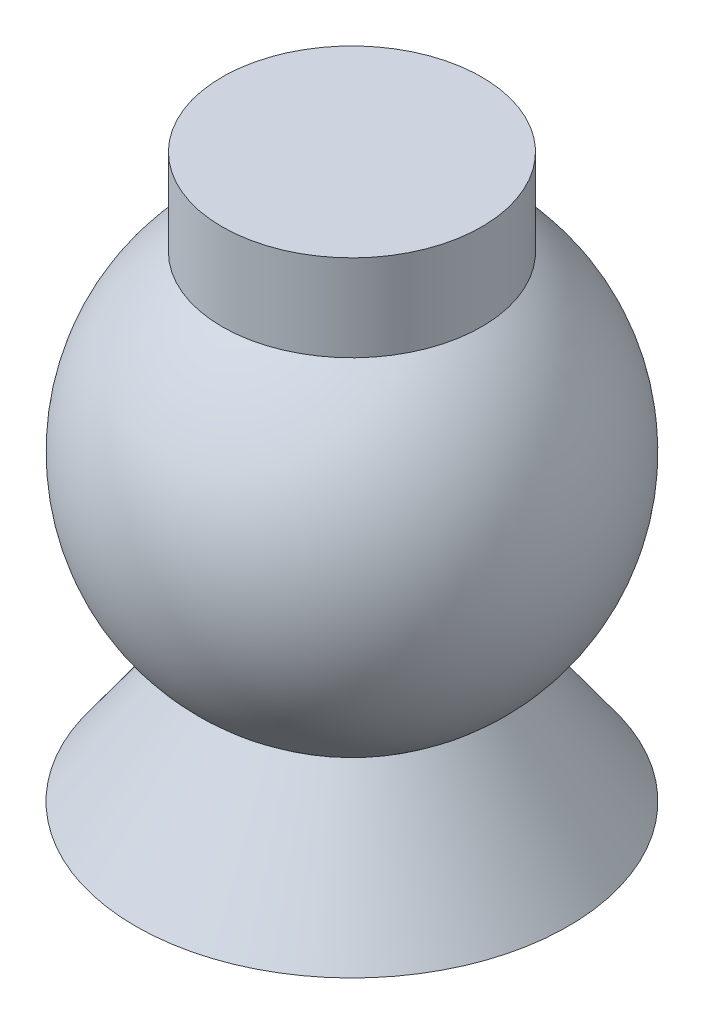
from build123d import *


with BuildPart() as part:
    # Sketch 1 → Revolve 1 (revolve)
    with BuildSketch(Plane.XY):
        with BuildLine():
            Line((0, 12), (-6, 12))
            Line((-6, 12), (-6, 8))
            ThreePointArc((-6, 8), (-9.99932421, -0.116255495), (-5.812381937, -8.137334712))
            Line((-5.812381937, -8.137334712), (-10, -14))
            Line((-10, -14), (0, -14))
            Line((0, -14), (0, 12))
        make_face()
    revolve(axis=Axis((0, 28.657977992, 0), (0, -1, 0)))


solid = part.part
